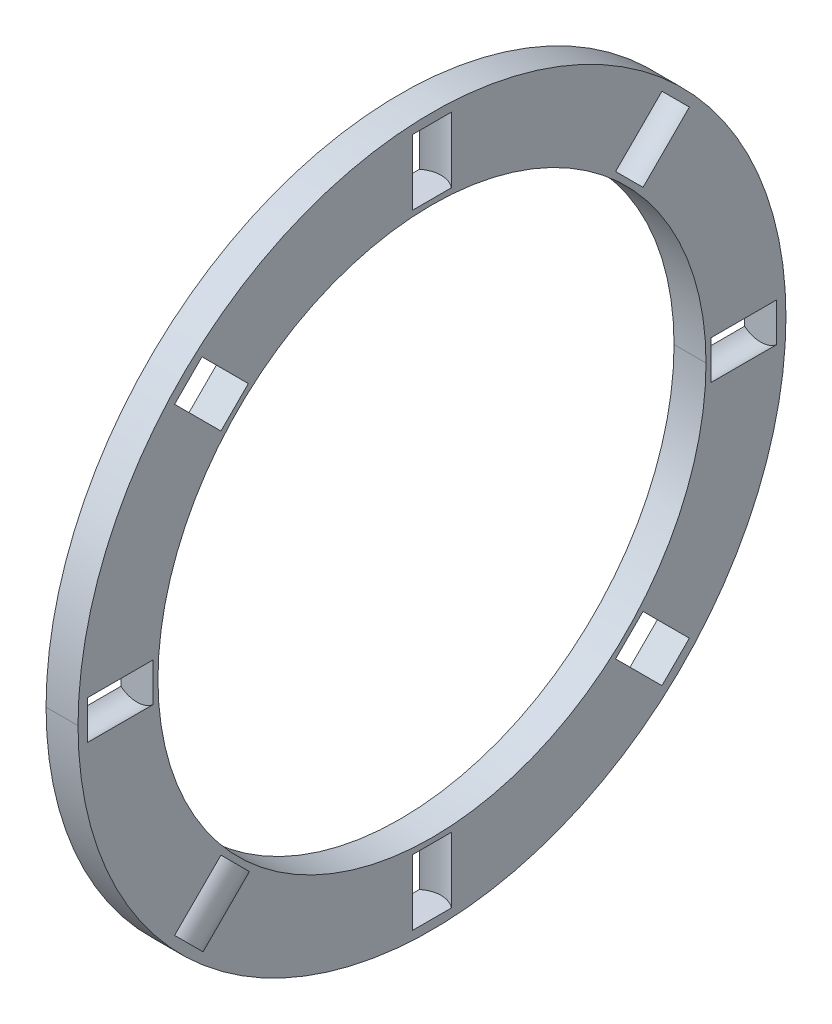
ISO-10303-21;
HEADER;
FILE_DESCRIPTION(('STEP AP214'),'2;1');
FILE_NAME('part.step','',(''),(''),'','','');
FILE_SCHEMA(('AUTOMOTIVE_DESIGN { 1 0 10303 214 1 1 1 1 }'));
ENDSEC;
DATA;
#1=APPLICATION_CONTEXT('core data for automotive mechanical design processes');
#2=APPLICATION_PROTOCOL_DEFINITION('international standard','automotive_design',2000,#1);
#3=PRODUCT_CONTEXT('',#1,'mechanical');
#4=PRODUCT('Part','Part','',(#3));
#5=PRODUCT_RELATED_PRODUCT_CATEGORY('part','',(#4));
#6=PRODUCT_DEFINITION_FORMATION('','',#4);
#7=PRODUCT_DEFINITION_CONTEXT('part definition',#1,'design');
#8=PRODUCT_DEFINITION('design','',#6,#7);
#9=PRODUCT_DEFINITION_SHAPE('','',#8);
#10=(LENGTH_UNIT() NAMED_UNIT(*) SI_UNIT(.MILLI.,.METRE.));
#11=(NAMED_UNIT(*) PLANE_ANGLE_UNIT() SI_UNIT($,.RADIAN.));
#12=(NAMED_UNIT(*) SI_UNIT($,.STERADIAN.) SOLID_ANGLE_UNIT());
#13=UNCERTAINTY_MEASURE_WITH_UNIT(LENGTH_MEASURE(1.E-05),#10,'distance_accuracy_value','');
#14=(GEOMETRIC_REPRESENTATION_CONTEXT(3) GLOBAL_UNCERTAINTY_ASSIGNED_CONTEXT((#13)) GLOBAL_UNIT_ASSIGNED_CONTEXT((#10,
#11,#12)) REPRESENTATION_CONTEXT('',''));
#15=CARTESIAN_POINT('',(0.,0.,0.));
#16=DIRECTION('',(0.,0.,1.));
#17=DIRECTION('',(1.,0.,0.));
#18=AXIS2_PLACEMENT_3D('',#15,#16,#17);
#19=CARTESIAN_POINT('',(12.5,43.2059920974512,-43.2059920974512));
#20=DIRECTION('',(0.,0.707106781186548,-0.707106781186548));
#21=DIRECTION('',(0.,0.707106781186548,0.707106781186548));
#22=AXIS2_PLACEMENT_3D('',#19,#20,#21);
#23=PLANE('',#22);
#24=DIRECTION('',(0.,0.707106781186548,0.707106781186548));
#25=VECTOR('',#24,1.);
#26=CARTESIAN_POINT('',(16.,73.2059920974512,-13.2059920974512));
#27=LINE('',#26,#25);
#28=CARTESIAN_POINT('',(16.,40.2059920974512,-46.2059920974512));
#29=VERTEX_POINT('',#28);
#30=CARTESIAN_POINT('',(16.,46.2059920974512,-40.2059920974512));
#31=VERTEX_POINT('',#30);
#32=EDGE_CURVE('E11',#29,#31,#27,.T.);
#33=ORIENTED_EDGE('',*,*,#32,.F.);
#34=CARTESIAN_POINT('',(12.5,43.2059920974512,-43.2059920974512));
#35=DIRECTION('',(0.,0.707106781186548,-0.707106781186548));
#36=DIRECTION('',(0.,0.707106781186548,0.707106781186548));
#37=AXIS2_PLACEMENT_3D('',#34,#35,#36);
#38=CIRCLE('',#37,5.5);
#39=CARTESIAN_POINT('',(9.,40.2059920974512,-46.2059920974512));
#40=VERTEX_POINT('',#39);
#41=EDGE_CURVE('E25',#29,#40,#38,.T.);
#42=ORIENTED_EDGE('',*,*,#41,.T.);
#43=DIRECTION('',(0.,-0.707106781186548,-0.707106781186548));
#44=VECTOR('',#43,1.);
#45=CARTESIAN_POINT('',(9.,81.9559920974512,-4.45599209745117));
#46=LINE('',#45,#44);
#47=CARTESIAN_POINT('',(9.,46.2059920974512,-40.2059920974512));
#48=VERTEX_POINT('',#47);
#49=EDGE_CURVE('E565',#48,#40,#46,.T.);
#50=ORIENTED_EDGE('',*,*,#49,.F.);
#51=CARTESIAN_POINT('',(12.5,43.2059920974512,-43.2059920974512));
#52=DIRECTION('',(0.,0.707106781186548,-0.707106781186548));
#53=DIRECTION('',(0.,0.707106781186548,0.707106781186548));
#54=AXIS2_PLACEMENT_3D('',#51,#52,#53);
#55=CIRCLE('',#54,5.5);
#56=EDGE_CURVE('E561',#48,#31,#55,.T.);
#57=ORIENTED_EDGE('',*,*,#56,.T.);
#58=EDGE_LOOP('',(#33,#42,#50,#57));
#59=FACE_BOUND('',#58,.T.);
#60=ADVANCED_FACE('F17',(#59),#23,.T.);
#61=CARTESIAN_POINT('',(12.5,53.3529744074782,-53.3529744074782));
#62=DIRECTION('',(0.,-0.707106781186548,0.707106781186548));
#63=DIRECTION('',(0.,-0.707106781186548,-0.707106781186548));
#64=AXIS2_PLACEMENT_3D('',#61,#62,#63);
#65=CYLINDRICAL_SURFACE('',#64,5.5);
#66=DIRECTION('',(0.,0.707106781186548,-0.707106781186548));
#67=VECTOR('',#66,1.);
#68=CARTESIAN_POINT('',(9.,56.3529744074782,-50.3529744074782));
#69=LINE('',#68,#67);
#70=CARTESIAN_POINT('',(9.,56.3529744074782,-50.3529744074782));
#71=VERTEX_POINT('',#70);
#72=EDGE_CURVE('E557',#48,#71,#69,.T.);
#73=ORIENTED_EDGE('',*,*,#72,.T.);
#74=CARTESIAN_POINT('',(12.5,53.3529744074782,-53.3529744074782));
#75=DIRECTION('',(0.,0.707106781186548,-0.707106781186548));
#76=DIRECTION('',(0.,0.707106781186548,0.707106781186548));
#77=AXIS2_PLACEMENT_3D('',#74,#75,#76);
#78=CIRCLE('',#77,5.5);
#79=CARTESIAN_POINT('',(16.,56.3529744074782,-50.3529744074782));
#80=VERTEX_POINT('',#79);
#81=EDGE_CURVE('E553',#71,#80,#78,.T.);
#82=ORIENTED_EDGE('',*,*,#81,.T.);
#83=DIRECTION('',(0.,0.707106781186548,-0.707106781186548));
#84=VECTOR('',#83,1.);
#85=CARTESIAN_POINT('',(16.,56.3529744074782,-50.3529744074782));
#86=LINE('',#85,#84);
#87=EDGE_CURVE('E548',#31,#80,#86,.T.);
#88=ORIENTED_EDGE('',*,*,#87,.F.);
#89=ORIENTED_EDGE('',*,*,#56,.F.);
#90=EDGE_LOOP('',(#73,#82,#88,#89));
#91=FACE_BOUND('',#90,.T.);
#92=ADVANCED_FACE('F861',(#91),#65,.F.);
#93=CARTESIAN_POINT('',(16.,60.,0.));
#94=DIRECTION('',(1.,0.,0.));
#95=DIRECTION('',(0.,0.,-1.));
#96=AXIS2_PLACEMENT_3D('',#93,#94,#95);
#97=PLANE('',#96);
#98=CARTESIAN_POINT('',(16.,0.,0.));
#99=DIRECTION('',(1.,0.,0.));
#100=DIRECTION('',(0.,0.,-1.));
#101=AXIS2_PLACEMENT_3D('',#98,#99,#100);
#102=CIRCLE('',#101,77.5);
#103=CARTESIAN_POINT('',(16.,0.,-77.5));
#104=VERTEX_POINT('',#103);
#105=CARTESIAN_POINT('',(16.,0.,77.5));
#106=VERTEX_POINT('',#105);
#107=EDGE_CURVE('E544',#104,#106,#102,.T.);
#108=ORIENTED_EDGE('',*,*,#107,.T.);
#109=CARTESIAN_POINT('',(16.,0.,0.));
#110=DIRECTION('',(1.,0.,0.));
#111=DIRECTION('',(0.,0.,-1.));
#112=AXIS2_PLACEMENT_3D('',#109,#110,#111);
#113=CIRCLE('',#112,77.5);
#114=EDGE_CURVE('E540',#106,#104,#113,.T.);
#115=ORIENTED_EDGE('',*,*,#114,.T.);
#116=EDGE_LOOP('',(#108,#115));
#117=FACE_BOUND('',#116,.T.);
#118=DIRECTION('',(0.,-1.,0.));
#119=VECTOR('',#118,1.);
#120=CARTESIAN_POINT('',(16.,61.1025,-4.24264068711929));
#121=LINE('',#120,#119);
#122=CARTESIAN_POINT('',(16.,75.4525,-4.24264068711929));
#123=VERTEX_POINT('',#122);
#124=CARTESIAN_POINT('',(16.,61.1025,-4.24264068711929));
#125=VERTEX_POINT('',#124);
#126=EDGE_CURVE('E536',#123,#125,#121,.T.);
#127=ORIENTED_EDGE('',*,*,#126,.T.);
#128=DIRECTION('',(0.,0.,1.));
#129=VECTOR('',#128,1.);
#130=CARTESIAN_POINT('',(16.,61.1025,0.));
#131=LINE('',#130,#129);
#132=CARTESIAN_POINT('',(16.,61.1025,4.24264068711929));
#133=VERTEX_POINT('',#132);
#134=EDGE_CURVE('E532',#125,#133,#131,.T.);
#135=ORIENTED_EDGE('',*,*,#134,.T.);
#136=DIRECTION('',(0.,-1.,0.));
#137=VECTOR('',#136,1.);
#138=CARTESIAN_POINT('',(16.,61.1025,4.24264068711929));
#139=LINE('',#138,#137);
#140=CARTESIAN_POINT('',(16.,75.4525,4.24264068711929));
#141=VERTEX_POINT('',#140);
#142=EDGE_CURVE('E527',#141,#133,#139,.T.);
#143=ORIENTED_EDGE('',*,*,#142,.F.);
#144=DIRECTION('',(0.,0.,-1.));
#145=VECTOR('',#144,1.);
#146=CARTESIAN_POINT('',(16.,75.4525,0.));
#147=LINE('',#146,#145);
#148=EDGE_CURVE('E523',#141,#123,#147,.T.);
#149=ORIENTED_EDGE('',*,*,#148,.T.);
#150=EDGE_LOOP('',(#127,#135,#143,#149));
#151=FACE_BOUND('',#150,.T.);
#152=CARTESIAN_POINT('',(16.,0.,0.));
#153=DIRECTION('',(1.,0.,0.));
#154=DIRECTION('',(0.,0.,-1.));
#155=AXIS2_PLACEMENT_3D('',#152,#153,#154);
#156=CIRCLE('',#155,60.);
#157=CARTESIAN_POINT('',(16.,0.,-60.));
#158=VERTEX_POINT('',#157);
#159=CARTESIAN_POINT('',(16.,0.,60.));
#160=VERTEX_POINT('',#159);
#161=EDGE_CURVE('E518',#158,#160,#156,.T.);
#162=ORIENTED_EDGE('',*,*,#161,.F.);
#163=CARTESIAN_POINT('',(16.,0.,0.));
#164=DIRECTION('',(1.,0.,0.));
#165=DIRECTION('',(0.,0.,-1.));
#166=AXIS2_PLACEMENT_3D('',#163,#164,#165);
#167=CIRCLE('',#166,60.);
#168=EDGE_CURVE('E513',#160,#158,#167,.T.);
#169=ORIENTED_EDGE('',*,*,#168,.F.);
#170=EDGE_LOOP('',(#162,#169));
#171=FACE_BOUND('',#170,.T.);
#172=DIRECTION('',(0.,-1.,0.));
#173=VECTOR('',#172,1.);
#174=CARTESIAN_POINT('',(16.,-75.4525,4.24264068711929));
#175=LINE('',#174,#173);
#176=CARTESIAN_POINT('',(16.,-61.1025,4.24264068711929));
#177=VERTEX_POINT('',#176);
#178=CARTESIAN_POINT('',(16.,-75.4525,4.24264068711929));
#179=VERTEX_POINT('',#178);
#180=EDGE_CURVE('E508',#177,#179,#175,.T.);
#181=ORIENTED_EDGE('',*,*,#180,.F.);
#182=DIRECTION('',(0.,0.,-1.));
#183=VECTOR('',#182,1.);
#184=CARTESIAN_POINT('',(16.,-61.1025,0.));
#185=LINE('',#184,#183);
#186=CARTESIAN_POINT('',(16.,-61.1025,-4.24264068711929));
#187=VERTEX_POINT('',#186);
#188=EDGE_CURVE('E504',#177,#187,#185,.T.);
#189=ORIENTED_EDGE('',*,*,#188,.T.);
#190=DIRECTION('',(0.,-1.,0.));
#191=VECTOR('',#190,1.);
#192=CARTESIAN_POINT('',(16.,-75.4525,-4.24264068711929));
#193=LINE('',#192,#191);
#194=CARTESIAN_POINT('',(16.,-75.4525,-4.24264068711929));
#195=VERTEX_POINT('',#194);
#196=EDGE_CURVE('E500',#187,#195,#193,.T.);
#197=ORIENTED_EDGE('',*,*,#196,.T.);
#198=DIRECTION('',(0.,0.,1.));
#199=VECTOR('',#198,1.);
#200=CARTESIAN_POINT('',(16.,-75.4525,0.));
#201=LINE('',#200,#199);
#202=EDGE_CURVE('E496',#195,#179,#201,.T.);
#203=ORIENTED_EDGE('',*,*,#202,.T.);
#204=EDGE_LOOP('',(#181,#189,#197,#203));
#205=FACE_BOUND('',#204,.T.);
#206=DIRECTION('',(0.,-0.707106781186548,-0.707106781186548));
#207=VECTOR('',#206,1.);
#208=CARTESIAN_POINT('',(16.,40.2059920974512,46.2059920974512));
#209=LINE('',#208,#207);
#210=CARTESIAN_POINT('',(16.,50.3529744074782,56.3529744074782));
#211=VERTEX_POINT('',#210);
#212=CARTESIAN_POINT('',(16.,40.2059920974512,46.2059920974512));
#213=VERTEX_POINT('',#212);
#214=EDGE_CURVE('E491',#211,#213,#209,.T.);
#215=ORIENTED_EDGE('',*,*,#214,.F.);
#216=DIRECTION('',(0.,0.707106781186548,-0.707106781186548));
#217=VECTOR('',#216,1.);
#218=CARTESIAN_POINT('',(16.,83.3529744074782,23.3529744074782));
#219=LINE('',#218,#217);
#220=CARTESIAN_POINT('',(16.,56.3529744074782,50.3529744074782));
#221=VERTEX_POINT('',#220);
#222=EDGE_CURVE('E487',#211,#221,#219,.T.);
#223=ORIENTED_EDGE('',*,*,#222,.T.);
#224=DIRECTION('',(0.,-0.707106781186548,-0.707106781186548));
#225=VECTOR('',#224,1.);
#226=CARTESIAN_POINT('',(16.,46.2059920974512,40.2059920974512));
#227=LINE('',#226,#225);
#228=CARTESIAN_POINT('',(16.,46.2059920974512,40.2059920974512));
#229=VERTEX_POINT('',#228);
#230=EDGE_CURVE('E483',#221,#229,#227,.T.);
#231=ORIENTED_EDGE('',*,*,#230,.T.);
#232=DIRECTION('',(0.,-0.707106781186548,0.707106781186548));
#233=VECTOR('',#232,1.);
#234=CARTESIAN_POINT('',(16.,73.2059920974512,13.2059920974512));
#235=LINE('',#234,#233);
#236=EDGE_CURVE('E479',#229,#213,#235,.T.);
#237=ORIENTED_EDGE('',*,*,#236,.T.);
#238=EDGE_LOOP('',(#215,#223,#231,#237));
#239=FACE_BOUND('',#238,.T.);
#240=DIRECTION('',(0.,-0.707106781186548,-0.707106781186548));
#241=VECTOR('',#240,1.);
#242=CARTESIAN_POINT('',(16.,-56.3529744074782,-50.3529744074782));
#243=LINE('',#242,#241);
#244=CARTESIAN_POINT('',(16.,-46.2059920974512,-40.2059920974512));
#245=VERTEX_POINT('',#244);
#246=CARTESIAN_POINT('',(16.,-56.3529744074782,-50.3529744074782));
#247=VERTEX_POINT('',#246);
#248=EDGE_CURVE('E474',#245,#247,#243,.T.);
#249=ORIENTED_EDGE('',*,*,#248,.F.);
#250=DIRECTION('',(0.,0.707106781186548,-0.707106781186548));
#251=VECTOR('',#250,1.);
#252=CARTESIAN_POINT('',(16.,-13.2059920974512,-73.2059920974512));
#253=LINE('',#252,#251);
#254=CARTESIAN_POINT('',(16.,-40.2059920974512,-46.2059920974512));
#255=VERTEX_POINT('',#254);
#256=EDGE_CURVE('E470',#245,#255,#253,.T.);
#257=ORIENTED_EDGE('',*,*,#256,.T.);
#258=DIRECTION('',(0.,-0.707106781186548,-0.707106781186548));
#259=VECTOR('',#258,1.);
#260=CARTESIAN_POINT('',(16.,-50.3529744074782,-56.3529744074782));
#261=LINE('',#260,#259);
#262=CARTESIAN_POINT('',(16.,-50.3529744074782,-56.3529744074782));
#263=VERTEX_POINT('',#262);
#264=EDGE_CURVE('E466',#255,#263,#261,.T.);
#265=ORIENTED_EDGE('',*,*,#264,.T.);
#266=DIRECTION('',(0.,-0.707106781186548,0.707106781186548));
#267=VECTOR('',#266,1.);
#268=CARTESIAN_POINT('',(16.,-23.3529744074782,-83.3529744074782));
#269=LINE('',#268,#267);
#270=EDGE_CURVE('E462',#263,#247,#269,.T.);
#271=ORIENTED_EDGE('',*,*,#270,.T.);
#272=EDGE_LOOP('',(#249,#257,#265,#271));
#273=FACE_BOUND('',#272,.T.);
#274=DIRECTION('',(0.,0.,-1.));
#275=VECTOR('',#274,1.);
#276=CARTESIAN_POINT('',(16.,-4.24264068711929,61.1025));
#277=LINE('',#276,#275);
#278=CARTESIAN_POINT('',(16.,-4.24264068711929,75.4525));
#279=VERTEX_POINT('',#278);
#280=CARTESIAN_POINT('',(16.,-4.24264068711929,61.1025));
#281=VERTEX_POINT('',#280);
#282=EDGE_CURVE('E457',#279,#281,#277,.T.);
#283=ORIENTED_EDGE('',*,*,#282,.F.);
#284=DIRECTION('',(0.,1.,0.));
#285=VECTOR('',#284,1.);
#286=CARTESIAN_POINT('',(16.,60.,75.4525));
#287=LINE('',#286,#285);
#288=CARTESIAN_POINT('',(16.,4.24264068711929,75.4525));
#289=VERTEX_POINT('',#288);
#290=EDGE_CURVE('E453',#279,#289,#287,.T.);
#291=ORIENTED_EDGE('',*,*,#290,.T.);
#292=DIRECTION('',(0.,0.,-1.));
#293=VECTOR('',#292,1.);
#294=CARTESIAN_POINT('',(16.,4.24264068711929,61.1025));
#295=LINE('',#294,#293);
#296=CARTESIAN_POINT('',(16.,4.24264068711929,61.1025));
#297=VERTEX_POINT('',#296);
#298=EDGE_CURVE('E449',#289,#297,#295,.T.);
#299=ORIENTED_EDGE('',*,*,#298,.T.);
#300=DIRECTION('',(0.,-1.,0.));
#301=VECTOR('',#300,1.);
#302=CARTESIAN_POINT('',(16.,60.,61.1025));
#303=LINE('',#302,#301);
#304=EDGE_CURVE('E445',#297,#281,#303,.T.);
#305=ORIENTED_EDGE('',*,*,#304,.T.);
#306=EDGE_LOOP('',(#283,#291,#299,#305));
#307=FACE_BOUND('',#306,.T.);
#308=DIRECTION('',(0.,0.,-1.));
#309=VECTOR('',#308,1.);
#310=CARTESIAN_POINT('',(16.,-4.24264068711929,-75.4525));
#311=LINE('',#310,#309);
#312=CARTESIAN_POINT('',(16.,-4.24264068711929,-61.1025));
#313=VERTEX_POINT('',#312);
#314=CARTESIAN_POINT('',(16.,-4.24264068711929,-75.4525));
#315=VERTEX_POINT('',#314);
#316=EDGE_CURVE('E440',#313,#315,#311,.T.);
#317=ORIENTED_EDGE('',*,*,#316,.F.);
#318=DIRECTION('',(0.,1.,0.));
#319=VECTOR('',#318,1.);
#320=CARTESIAN_POINT('',(16.,60.,-61.1025));
#321=LINE('',#320,#319);
#322=CARTESIAN_POINT('',(16.,4.24264068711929,-61.1025));
#323=VERTEX_POINT('',#322);
#324=EDGE_CURVE('E436',#313,#323,#321,.T.);
#325=ORIENTED_EDGE('',*,*,#324,.T.);
#326=DIRECTION('',(0.,0.,-1.));
#327=VECTOR('',#326,1.);
#328=CARTESIAN_POINT('',(16.,4.24264068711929,-75.4525));
#329=LINE('',#328,#327);
#330=CARTESIAN_POINT('',(16.,4.24264068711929,-75.4525));
#331=VERTEX_POINT('',#330);
#332=EDGE_CURVE('E432',#323,#331,#329,.T.);
#333=ORIENTED_EDGE('',*,*,#332,.T.);
#334=DIRECTION('',(0.,-1.,0.));
#335=VECTOR('',#334,1.);
#336=CARTESIAN_POINT('',(16.,60.,-75.4525));
#337=LINE('',#336,#335);
#338=EDGE_CURVE('E428',#331,#315,#337,.T.);
#339=ORIENTED_EDGE('',*,*,#338,.T.);
#340=EDGE_LOOP('',(#317,#325,#333,#339));
#341=FACE_BOUND('',#340,.T.);
#342=DIRECTION('',(0.,0.707106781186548,-0.707106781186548));
#343=VECTOR('',#342,1.);
#344=CARTESIAN_POINT('',(16.,-46.2059920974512,40.2059920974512));
#345=LINE('',#344,#343);
#346=CARTESIAN_POINT('',(16.,-56.3529744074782,50.3529744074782));
#347=VERTEX_POINT('',#346);
#348=CARTESIAN_POINT('',(16.,-46.2059920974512,40.2059920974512));
#349=VERTEX_POINT('',#348);
#350=EDGE_CURVE('E423',#347,#349,#345,.T.);
#351=ORIENTED_EDGE('',*,*,#350,.F.);
#352=DIRECTION('',(0.,0.707106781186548,0.707106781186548));
#353=VECTOR('',#352,1.);
#354=CARTESIAN_POINT('',(16.,-23.3529744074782,83.3529744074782));
#355=LINE('',#354,#353);
#356=CARTESIAN_POINT('',(16.,-50.3529744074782,56.3529744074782));
#357=VERTEX_POINT('',#356);
#358=EDGE_CURVE('E419',#347,#357,#355,.T.);
#359=ORIENTED_EDGE('',*,*,#358,.T.);
#360=DIRECTION('',(0.,0.707106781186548,-0.707106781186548));
#361=VECTOR('',#360,1.);
#362=CARTESIAN_POINT('',(16.,-40.2059920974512,46.2059920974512));
#363=LINE('',#362,#361);
#364=CARTESIAN_POINT('',(16.,-40.2059920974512,46.2059920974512));
#365=VERTEX_POINT('',#364);
#366=EDGE_CURVE('E415',#357,#365,#363,.T.);
#367=ORIENTED_EDGE('',*,*,#366,.T.);
#368=DIRECTION('',(0.,-0.707106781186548,-0.707106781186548));
#369=VECTOR('',#368,1.);
#370=CARTESIAN_POINT('',(16.,-13.2059920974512,73.2059920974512));
#371=LINE('',#370,#369);
#372=EDGE_CURVE('E411',#365,#349,#371,.T.);
#373=ORIENTED_EDGE('',*,*,#372,.T.);
#374=EDGE_LOOP('',(#351,#359,#367,#373));
#375=FACE_BOUND('',#374,.T.);
#376=DIRECTION('',(0.,0.707106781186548,-0.707106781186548));
#377=VECTOR('',#376,1.);
#378=CARTESIAN_POINT('',(16.,50.3529744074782,-56.3529744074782));
#379=LINE('',#378,#377);
#380=CARTESIAN_POINT('',(16.,50.3529744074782,-56.3529744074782));
#381=VERTEX_POINT('',#380);
#382=EDGE_CURVE('E406',#29,#381,#379,.T.);
#383=ORIENTED_EDGE('',*,*,#382,.F.);
#384=ORIENTED_EDGE('',*,*,#32,.T.);
#385=ORIENTED_EDGE('',*,*,#87,.T.);
#386=DIRECTION('',(0.,-0.707106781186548,-0.707106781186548));
#387=VECTOR('',#386,1.);
#388=CARTESIAN_POINT('',(16.,83.3529744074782,-23.3529744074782));
#389=LINE('',#388,#387);
#390=EDGE_CURVE('E402',#80,#381,#389,.T.);
#391=ORIENTED_EDGE('',*,*,#390,.T.);
#392=EDGE_LOOP('',(#383,#384,#385,#391));
#393=FACE_BOUND('',#392,.T.);
#394=ADVANCED_FACE('F848',(#117,#151,#171,#205,#239,#273,#307,#341,#375,#393),#97,.T.);
#395=CARTESIAN_POINT('',(18.,53.3529744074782,-53.3529744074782));
#396=DIRECTION('',(0.,-0.707106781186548,0.707106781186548));
#397=DIRECTION('',(0.,-0.707106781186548,-0.707106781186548));
#398=AXIS2_PLACEMENT_3D('',#395,#396,#397);
#399=PLANE('',#398);
#400=CARTESIAN_POINT('',(12.5,53.3529744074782,-53.3529744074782));
#401=DIRECTION('',(0.,0.707106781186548,-0.707106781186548));
#402=DIRECTION('',(0.,0.707106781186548,0.707106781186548));
#403=AXIS2_PLACEMENT_3D('',#400,#401,#402);
#404=CIRCLE('',#403,5.5);
#405=CARTESIAN_POINT('',(9.,50.3529744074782,-56.3529744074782));
#406=VERTEX_POINT('',#405);
#407=EDGE_CURVE('E397',#381,#406,#404,.T.);
#408=ORIENTED_EDGE('',*,*,#407,.F.);
#409=ORIENTED_EDGE('',*,*,#390,.F.);
#410=ORIENTED_EDGE('',*,*,#81,.F.);
#411=DIRECTION('',(0.,0.707106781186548,0.707106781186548));
#412=VECTOR('',#411,1.);
#413=CARTESIAN_POINT('',(9.,92.1029744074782,-14.6029744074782));
#414=LINE('',#413,#412);
#415=EDGE_CURVE('E392',#406,#71,#414,.T.);
#416=ORIENTED_EDGE('',*,*,#415,.F.);
#417=EDGE_LOOP('',(#408,#409,#410,#416));
#418=FACE_BOUND('',#417,.T.);
#419=ADVANCED_FACE('F869',(#418),#399,.T.);
#420=CARTESIAN_POINT('',(9.,77.5,0.));
#421=DIRECTION('',(-1.,0.,0.));
#422=DIRECTION('',(0.,0.,1.));
#423=AXIS2_PLACEMENT_3D('',#420,#421,#422);
#424=PLANE('',#423);
#425=CARTESIAN_POINT('',(9.,0.,0.));
#426=DIRECTION('',(1.,0.,0.));
#427=DIRECTION('',(0.,0.,-1.));
#428=AXIS2_PLACEMENT_3D('',#425,#426,#427);
#429=CIRCLE('',#428,60.);
#430=CARTESIAN_POINT('',(9.,0.,-60.));
#431=VERTEX_POINT('',#430);
#432=CARTESIAN_POINT('',(9.,0.,60.));
#433=VERTEX_POINT('',#432);
#434=EDGE_CURVE('E388',#431,#433,#429,.T.);
#435=ORIENTED_EDGE('',*,*,#434,.T.);
#436=CARTESIAN_POINT('',(9.,0.,0.));
#437=DIRECTION('',(1.,0.,0.));
#438=DIRECTION('',(0.,0.,-1.));
#439=AXIS2_PLACEMENT_3D('',#436,#437,#438);
#440=CIRCLE('',#439,60.);
#441=EDGE_CURVE('E384',#433,#431,#440,.T.);
#442=ORIENTED_EDGE('',*,*,#441,.T.);
#443=EDGE_LOOP('',(#435,#442));
#444=FACE_BOUND('',#443,.T.);
#445=DIRECTION('',(0.,0.,1.));
#446=VECTOR('',#445,1.);
#447=CARTESIAN_POINT('',(9.,75.4525,0.));
#448=LINE('',#447,#446);
#449=CARTESIAN_POINT('',(9.,75.4525,-4.24264068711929));
#450=VERTEX_POINT('',#449);
#451=CARTESIAN_POINT('',(9.,75.4525,4.24264068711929));
#452=VERTEX_POINT('',#451);
#453=EDGE_CURVE('E380',#450,#452,#448,.T.);
#454=ORIENTED_EDGE('',*,*,#453,.T.);
#455=DIRECTION('',(0.,-1.,0.));
#456=VECTOR('',#455,1.);
#457=CARTESIAN_POINT('',(9.,61.1025,4.24264068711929));
#458=LINE('',#457,#456);
#459=CARTESIAN_POINT('',(9.,61.1025,4.24264068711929));
#460=VERTEX_POINT('',#459);
#461=EDGE_CURVE('E376',#452,#460,#458,.T.);
#462=ORIENTED_EDGE('',*,*,#461,.T.);
#463=DIRECTION('',(0.,0.,-1.));
#464=VECTOR('',#463,1.);
#465=CARTESIAN_POINT('',(9.,61.1025,0.));
#466=LINE('',#465,#464);
#467=CARTESIAN_POINT('',(9.,61.1025,-4.24264068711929));
#468=VERTEX_POINT('',#467);
#469=EDGE_CURVE('E372',#460,#468,#466,.T.);
#470=ORIENTED_EDGE('',*,*,#469,.T.);
#471=DIRECTION('',(0.,-1.,0.));
#472=VECTOR('',#471,1.);
#473=CARTESIAN_POINT('',(9.,61.1025,-4.24264068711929));
#474=LINE('',#473,#472);
#475=EDGE_CURVE('E367',#450,#468,#474,.T.);
#476=ORIENTED_EDGE('',*,*,#475,.F.);
#477=EDGE_LOOP('',(#454,#462,#470,#476));
#478=FACE_BOUND('',#477,.T.);
#479=CARTESIAN_POINT('',(9.,0.,0.));
#480=DIRECTION('',(1.,0.,0.));
#481=DIRECTION('',(0.,0.,-1.));
#482=AXIS2_PLACEMENT_3D('',#479,#480,#481);
#483=CIRCLE('',#482,77.5);
#484=CARTESIAN_POINT('',(9.,0.,-77.5));
#485=VERTEX_POINT('',#484);
#486=CARTESIAN_POINT('',(9.,0.,77.5));
#487=VERTEX_POINT('',#486);
#488=EDGE_CURVE('E362',#485,#487,#483,.T.);
#489=ORIENTED_EDGE('',*,*,#488,.F.);
#490=CARTESIAN_POINT('',(9.,0.,0.));
#491=DIRECTION('',(1.,0.,0.));
#492=DIRECTION('',(0.,0.,-1.));
#493=AXIS2_PLACEMENT_3D('',#490,#491,#492);
#494=CIRCLE('',#493,77.5);
#495=EDGE_CURVE('E357',#487,#485,#494,.T.);
#496=ORIENTED_EDGE('',*,*,#495,.F.);
#497=EDGE_LOOP('',(#489,#496));
#498=FACE_BOUND('',#497,.T.);
#499=DIRECTION('',(0.,-1.,0.));
#500=VECTOR('',#499,1.);
#501=CARTESIAN_POINT('',(9.,-75.4525,-4.24264068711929));
#502=LINE('',#501,#500);
#503=CARTESIAN_POINT('',(9.,-61.1025,-4.24264068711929));
#504=VERTEX_POINT('',#503);
#505=CARTESIAN_POINT('',(9.,-75.4525,-4.24264068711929));
#506=VERTEX_POINT('',#505);
#507=EDGE_CURVE('E352',#504,#506,#502,.T.);
#508=ORIENTED_EDGE('',*,*,#507,.F.);
#509=DIRECTION('',(0.,0.,1.));
#510=VECTOR('',#509,1.);
#511=CARTESIAN_POINT('',(9.,-61.1025,0.));
#512=LINE('',#511,#510);
#513=CARTESIAN_POINT('',(9.,-61.1025,4.24264068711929));
#514=VERTEX_POINT('',#513);
#515=EDGE_CURVE('E348',#504,#514,#512,.T.);
#516=ORIENTED_EDGE('',*,*,#515,.T.);
#517=DIRECTION('',(0.,-1.,0.));
#518=VECTOR('',#517,1.);
#519=CARTESIAN_POINT('',(9.,-75.4525,4.24264068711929));
#520=LINE('',#519,#518);
#521=CARTESIAN_POINT('',(9.,-75.4525,4.24264068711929));
#522=VERTEX_POINT('',#521);
#523=EDGE_CURVE('E344',#514,#522,#520,.T.);
#524=ORIENTED_EDGE('',*,*,#523,.T.);
#525=DIRECTION('',(0.,0.,-1.));
#526=VECTOR('',#525,1.);
#527=CARTESIAN_POINT('',(9.,-75.4525,0.));
#528=LINE('',#527,#526);
#529=EDGE_CURVE('E340',#522,#506,#528,.T.);
#530=ORIENTED_EDGE('',*,*,#529,.T.);
#531=EDGE_LOOP('',(#508,#516,#524,#530));
#532=FACE_BOUND('',#531,.T.);
#533=DIRECTION('',(0.,-0.707106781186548,-0.707106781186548));
#534=VECTOR('',#533,1.);
#535=CARTESIAN_POINT('',(9.,46.2059920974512,40.2059920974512));
#536=LINE('',#535,#534);
#537=CARTESIAN_POINT('',(9.,56.3529744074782,50.3529744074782));
#538=VERTEX_POINT('',#537);
#539=CARTESIAN_POINT('',(9.,46.2059920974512,40.2059920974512));
#540=VERTEX_POINT('',#539);
#541=EDGE_CURVE('E335',#538,#540,#536,.T.);
#542=ORIENTED_EDGE('',*,*,#541,.F.);
#543=DIRECTION('',(0.,-0.707106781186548,0.707106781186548));
#544=VECTOR('',#543,1.);
#545=CARTESIAN_POINT('',(9.,92.1029744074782,14.6029744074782));
#546=LINE('',#545,#544);
#547=CARTESIAN_POINT('',(9.,50.3529744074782,56.3529744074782));
#548=VERTEX_POINT('',#547);
#549=EDGE_CURVE('E331',#538,#548,#546,.T.);
#550=ORIENTED_EDGE('',*,*,#549,.T.);
#551=DIRECTION('',(0.,-0.707106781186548,-0.707106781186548));
#552=VECTOR('',#551,1.);
#553=CARTESIAN_POINT('',(9.,40.2059920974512,46.2059920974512));
#554=LINE('',#553,#552);
#555=CARTESIAN_POINT('',(9.,40.2059920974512,46.2059920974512));
#556=VERTEX_POINT('',#555);
#557=EDGE_CURVE('E327',#548,#556,#554,.T.);
#558=ORIENTED_EDGE('',*,*,#557,.T.);
#559=DIRECTION('',(0.,0.707106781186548,-0.707106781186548));
#560=VECTOR('',#559,1.);
#561=CARTESIAN_POINT('',(9.,81.9559920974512,4.45599209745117));
#562=LINE('',#561,#560);
#563=EDGE_CURVE('E323',#556,#540,#562,.T.);
#564=ORIENTED_EDGE('',*,*,#563,.T.);
#565=EDGE_LOOP('',(#542,#550,#558,#564));
#566=FACE_BOUND('',#565,.T.);
#567=DIRECTION('',(0.,-0.707106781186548,-0.707106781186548));
#568=VECTOR('',#567,1.);
#569=CARTESIAN_POINT('',(9.,-50.3529744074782,-56.3529744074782));
#570=LINE('',#569,#568);
#571=CARTESIAN_POINT('',(9.,-40.2059920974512,-46.2059920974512));
#572=VERTEX_POINT('',#571);
#573=CARTESIAN_POINT('',(9.,-50.3529744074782,-56.3529744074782));
#574=VERTEX_POINT('',#573);
#575=EDGE_CURVE('E318',#572,#574,#570,.T.);
#576=ORIENTED_EDGE('',*,*,#575,.F.);
#577=DIRECTION('',(0.,-0.707106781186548,0.707106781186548));
#578=VECTOR('',#577,1.);
#579=CARTESIAN_POINT('',(9.,-4.45599209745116,-81.9559920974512));
#580=LINE('',#579,#578);
#581=CARTESIAN_POINT('',(9.,-46.2059920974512,-40.2059920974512));
#582=VERTEX_POINT('',#581);
#583=EDGE_CURVE('E314',#572,#582,#580,.T.);
#584=ORIENTED_EDGE('',*,*,#583,.T.);
#585=DIRECTION('',(0.,-0.707106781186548,-0.707106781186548));
#586=VECTOR('',#585,1.);
#587=CARTESIAN_POINT('',(9.,-56.3529744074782,-50.3529744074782));
#588=LINE('',#587,#586);
#589=CARTESIAN_POINT('',(9.,-56.3529744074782,-50.3529744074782));
#590=VERTEX_POINT('',#589);
#591=EDGE_CURVE('E310',#582,#590,#588,.T.);
#592=ORIENTED_EDGE('',*,*,#591,.T.);
#593=DIRECTION('',(0.,0.707106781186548,-0.707106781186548));
#594=VECTOR('',#593,1.);
#595=CARTESIAN_POINT('',(9.,-14.6029744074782,-92.1029744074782));
#596=LINE('',#595,#594);
#597=EDGE_CURVE('E306',#590,#574,#596,.T.);
#598=ORIENTED_EDGE('',*,*,#597,.T.);
#599=EDGE_LOOP('',(#576,#584,#592,#598));
#600=FACE_BOUND('',#599,.T.);
#601=DIRECTION('',(0.,0.,-1.));
#602=VECTOR('',#601,1.);
#603=CARTESIAN_POINT('',(9.,4.24264068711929,61.1025));
#604=LINE('',#603,#602);
#605=CARTESIAN_POINT('',(9.,4.24264068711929,75.4525));
#606=VERTEX_POINT('',#605);
#607=CARTESIAN_POINT('',(9.,4.24264068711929,61.1025));
#608=VERTEX_POINT('',#607);
#609=EDGE_CURVE('E301',#606,#608,#604,.T.);
#610=ORIENTED_EDGE('',*,*,#609,.F.);
#611=DIRECTION('',(0.,-1.,0.));
#612=VECTOR('',#611,1.);
#613=CARTESIAN_POINT('',(9.,77.5,75.4525));
#614=LINE('',#613,#612);
#615=CARTESIAN_POINT('',(9.,-4.24264068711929,75.4525));
#616=VERTEX_POINT('',#615);
#617=EDGE_CURVE('E297',#606,#616,#614,.T.);
#618=ORIENTED_EDGE('',*,*,#617,.T.);
#619=DIRECTION('',(0.,0.,-1.));
#620=VECTOR('',#619,1.);
#621=CARTESIAN_POINT('',(9.,-4.24264068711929,61.1025));
#622=LINE('',#621,#620);
#623=CARTESIAN_POINT('',(9.,-4.24264068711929,61.1025));
#624=VERTEX_POINT('',#623);
#625=EDGE_CURVE('E293',#616,#624,#622,.T.);
#626=ORIENTED_EDGE('',*,*,#625,.T.);
#627=DIRECTION('',(0.,1.,0.));
#628=VECTOR('',#627,1.);
#629=CARTESIAN_POINT('',(9.,77.5,61.1025));
#630=LINE('',#629,#628);
#631=EDGE_CURVE('E289',#624,#608,#630,.T.);
#632=ORIENTED_EDGE('',*,*,#631,.T.);
#633=EDGE_LOOP('',(#610,#618,#626,#632));
#634=FACE_BOUND('',#633,.T.);
#635=DIRECTION('',(0.,0.,-1.));
#636=VECTOR('',#635,1.);
#637=CARTESIAN_POINT('',(9.,4.24264068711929,-75.4525));
#638=LINE('',#637,#636);
#639=CARTESIAN_POINT('',(9.,4.24264068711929,-61.1025));
#640=VERTEX_POINT('',#639);
#641=CARTESIAN_POINT('',(9.,4.24264068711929,-75.4525));
#642=VERTEX_POINT('',#641);
#643=EDGE_CURVE('E284',#640,#642,#638,.T.);
#644=ORIENTED_EDGE('',*,*,#643,.F.);
#645=DIRECTION('',(0.,-1.,0.));
#646=VECTOR('',#645,1.);
#647=CARTESIAN_POINT('',(9.,77.5,-61.1025));
#648=LINE('',#647,#646);
#649=CARTESIAN_POINT('',(9.,-4.24264068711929,-61.1025));
#650=VERTEX_POINT('',#649);
#651=EDGE_CURVE('E280',#640,#650,#648,.T.);
#652=ORIENTED_EDGE('',*,*,#651,.T.);
#653=DIRECTION('',(0.,0.,-1.));
#654=VECTOR('',#653,1.);
#655=CARTESIAN_POINT('',(9.,-4.24264068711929,-75.4525));
#656=LINE('',#655,#654);
#657=CARTESIAN_POINT('',(9.,-4.24264068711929,-75.4525));
#658=VERTEX_POINT('',#657);
#659=EDGE_CURVE('E269',#650,#658,#656,.T.);
#660=ORIENTED_EDGE('',*,*,#659,.T.);
#661=DIRECTION('',(0.,1.,0.));
#662=VECTOR('',#661,1.);
#663=CARTESIAN_POINT('',(9.,77.5,-75.4525));
#664=LINE('',#663,#662);
#665=EDGE_CURVE('E266',#658,#642,#664,.T.);
#666=ORIENTED_EDGE('',*,*,#665,.T.);
#667=EDGE_LOOP('',(#644,#652,#660,#666));
#668=FACE_BOUND('',#667,.T.);
#669=DIRECTION('',(0.,0.707106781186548,-0.707106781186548));
#670=VECTOR('',#669,1.);
#671=CARTESIAN_POINT('',(9.,-40.2059920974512,46.2059920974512));
#672=LINE('',#671,#670);
#673=CARTESIAN_POINT('',(9.,-50.3529744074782,56.3529744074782));
#674=VERTEX_POINT('',#673);
#675=CARTESIAN_POINT('',(9.,-40.2059920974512,46.2059920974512));
#676=VERTEX_POINT('',#675);
#677=EDGE_CURVE('E250',#674,#676,#672,.T.);
#678=ORIENTED_EDGE('',*,*,#677,.F.);
#679=DIRECTION('',(0.,-0.707106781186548,-0.707106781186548));
#680=VECTOR('',#679,1.);
#681=CARTESIAN_POINT('',(9.,-14.6029744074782,92.1029744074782));
#682=LINE('',#681,#680);
#683=CARTESIAN_POINT('',(9.,-56.3529744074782,50.3529744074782));
#684=VERTEX_POINT('',#683);
#685=EDGE_CURVE('E267',#674,#684,#682,.T.);
#686=ORIENTED_EDGE('',*,*,#685,.T.);
#687=DIRECTION('',(0.,0.707106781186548,-0.707106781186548));
#688=VECTOR('',#687,1.);
#689=CARTESIAN_POINT('',(9.,-46.2059920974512,40.2059920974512));
#690=LINE('',#689,#688);
#691=CARTESIAN_POINT('',(9.,-46.2059920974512,40.2059920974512));
#692=VERTEX_POINT('',#691);
#693=EDGE_CURVE('E253',#684,#692,#690,.T.);
#694=ORIENTED_EDGE('',*,*,#693,.T.);
#695=DIRECTION('',(0.,0.707106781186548,0.707106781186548));
#696=VECTOR('',#695,1.);
#697=CARTESIAN_POINT('',(9.,-4.45599209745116,81.9559920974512));
#698=LINE('',#697,#696);
#699=EDGE_CURVE('E245',#692,#676,#698,.T.);
#700=ORIENTED_EDGE('',*,*,#699,.T.);
#701=EDGE_LOOP('',(#678,#686,#694,#700));
#702=FACE_BOUND('',#701,.T.);
#703=ORIENTED_EDGE('',*,*,#72,.F.);
#704=ORIENTED_EDGE('',*,*,#49,.T.);
#705=DIRECTION('',(0.,0.707106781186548,-0.707106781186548));
#706=VECTOR('',#705,1.);
#707=CARTESIAN_POINT('',(9.,50.3529744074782,-56.3529744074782));
#708=LINE('',#707,#706);
#709=EDGE_CURVE('E256',#40,#406,#708,.T.);
#710=ORIENTED_EDGE('',*,*,#709,.T.);
#711=ORIENTED_EDGE('',*,*,#415,.T.);
#712=EDGE_LOOP('',(#703,#704,#710,#711));
#713=FACE_BOUND('',#712,.T.);
#714=ADVANCED_FACE('F247',(#444,#478,#498,#532,#566,#600,#634,#668,#702,#713),#424,.T.);
#715=CARTESIAN_POINT('',(12.5,53.3529744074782,-53.3529744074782));
#716=DIRECTION('',(0.,-0.707106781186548,0.707106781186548));
#717=DIRECTION('',(0.,0.707106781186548,0.707106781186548));
#718=AXIS2_PLACEMENT_3D('',#715,#716,#717);
#719=CYLINDRICAL_SURFACE('',#718,5.5);
#720=ORIENTED_EDGE('',*,*,#709,.F.);
#721=ORIENTED_EDGE('',*,*,#41,.F.);
#722=ORIENTED_EDGE('',*,*,#382,.T.);
#723=ORIENTED_EDGE('',*,*,#407,.T.);
#724=EDGE_LOOP('',(#720,#721,#722,#723));
#725=FACE_BOUND('',#724,.T.);
#726=ADVANCED_FACE('F578',(#725),#719,.F.);
#727=CARTESIAN_POINT('',(18.,-43.2059920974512,43.2059920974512));
#728=DIRECTION('',(0.,-0.707106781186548,0.707106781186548));
#729=DIRECTION('',(0.,-0.707106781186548,-0.707106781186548));
#730=AXIS2_PLACEMENT_3D('',#727,#728,#729);
#731=PLANE('',#730);
#732=ORIENTED_EDGE('',*,*,#699,.F.);
#733=CARTESIAN_POINT('',(12.5,-43.2059920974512,43.2059920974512));
#734=DIRECTION('',(0.,0.707106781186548,-0.707106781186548));
#735=DIRECTION('',(0.,0.707106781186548,0.707106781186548));
#736=AXIS2_PLACEMENT_3D('',#733,#734,#735);
#737=CIRCLE('',#736,5.5);
#738=EDGE_CURVE('E258',#692,#676,#737,.T.);
#739=ORIENTED_EDGE('',*,*,#738,.T.);
#740=EDGE_LOOP('',(#732,#739));
#741=FACE_BOUND('',#740,.T.);
#742=ADVANCED_FACE('F259',(#741),#731,.F.);
#743=CARTESIAN_POINT('',(12.5,-43.2059920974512,43.2059920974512));
#744=DIRECTION('',(0.,-0.707106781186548,0.707106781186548));
#745=DIRECTION('',(1.,0.,0.));
#746=AXIS2_PLACEMENT_3D('',#743,#744,#745);
#747=CYLINDRICAL_SURFACE('',#746,5.5);
#748=ORIENTED_EDGE('',*,*,#677,.T.);
#749=ORIENTED_EDGE('',*,*,#738,.F.);
#750=ORIENTED_EDGE('',*,*,#693,.F.);
#751=CARTESIAN_POINT('',(12.5,-53.3529744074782,53.3529744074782));
#752=DIRECTION('',(0.,0.707106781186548,-0.707106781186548));
#753=DIRECTION('',(0.,0.707106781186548,0.707106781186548));
#754=AXIS2_PLACEMENT_3D('',#751,#752,#753);
#755=CIRCLE('',#754,5.5);
#756=EDGE_CURVE('E261',#684,#674,#755,.T.);
#757=ORIENTED_EDGE('',*,*,#756,.T.);
#758=EDGE_LOOP('',(#748,#749,#750,#757));
#759=FACE_BOUND('',#758,.T.);
#760=ADVANCED_FACE('F263',(#759),#747,.T.);
#761=CARTESIAN_POINT('',(12.5,-53.3529744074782,53.3529744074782));
#762=DIRECTION('',(0.,0.707106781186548,-0.707106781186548));
#763=DIRECTION('',(0.,0.707106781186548,0.707106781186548));
#764=AXIS2_PLACEMENT_3D('',#761,#762,#763);
#765=PLANE('',#764);
#766=ORIENTED_EDGE('',*,*,#685,.F.);
#767=ORIENTED_EDGE('',*,*,#756,.F.);
#768=EDGE_LOOP('',(#766,#767));
#769=FACE_BOUND('',#768,.T.);
#770=ADVANCED_FACE('F885',(#769),#765,.F.);
#771=CARTESIAN_POINT('',(18.,0.,-75.4525));
#772=DIRECTION('',(0.,0.,1.));
#773=DIRECTION('',(1.,0.,0.));
#774=AXIS2_PLACEMENT_3D('',#771,#772,#773);
#775=PLANE('',#774);
#776=CARTESIAN_POINT('',(12.5,0.,-75.4525));
#777=DIRECTION('',(0.,0.,-1.));
#778=DIRECTION('',(-1.,0.,0.));
#779=AXIS2_PLACEMENT_3D('',#776,#777,#778);
#780=CIRCLE('',#779,5.5);
#781=EDGE_CURVE('E594',#315,#658,#780,.T.);
#782=ORIENTED_EDGE('',*,*,#781,.F.);
#783=ORIENTED_EDGE('',*,*,#338,.F.);
#784=CARTESIAN_POINT('',(12.5,0.,-75.4525));
#785=DIRECTION('',(0.,0.,-1.));
#786=DIRECTION('',(-1.,0.,0.));
#787=AXIS2_PLACEMENT_3D('',#784,#785,#786);
#788=CIRCLE('',#787,5.5);
#789=EDGE_CURVE('E599',#642,#331,#788,.T.);
#790=ORIENTED_EDGE('',*,*,#789,.F.);
#791=ORIENTED_EDGE('',*,*,#665,.F.);
#792=EDGE_LOOP('',(#782,#783,#790,#791));
#793=FACE_BOUND('',#792,.T.);
#794=ADVANCED_FACE('F888',(#793),#775,.T.);
#795=CARTESIAN_POINT('',(12.5,0.,-75.4525));
#796=DIRECTION('',(0.,0.,1.));
#797=DIRECTION('',(0.,-1.,0.));
#798=AXIS2_PLACEMENT_3D('',#795,#796,#797);
#799=CYLINDRICAL_SURFACE('',#798,5.5);
#800=ORIENTED_EDGE('',*,*,#643,.T.);
#801=ORIENTED_EDGE('',*,*,#789,.T.);
#802=ORIENTED_EDGE('',*,*,#332,.F.);
#803=CARTESIAN_POINT('',(12.5,0.,-61.1025));
#804=DIRECTION('',(0.,0.,-1.));
#805=DIRECTION('',(-1.,0.,0.));
#806=AXIS2_PLACEMENT_3D('',#803,#804,#805);
#807=CIRCLE('',#806,5.5);
#808=EDGE_CURVE('E604',#640,#323,#807,.T.);
#809=ORIENTED_EDGE('',*,*,#808,.F.);
#810=EDGE_LOOP('',(#800,#801,#802,#809));
#811=FACE_BOUND('',#810,.T.);
#812=ADVANCED_FACE('F892',(#811),#799,.F.);
#813=CARTESIAN_POINT('',(12.5,0.,-61.1025));
#814=DIRECTION('',(0.,0.,-1.));
#815=DIRECTION('',(-1.,0.,0.));
#816=AXIS2_PLACEMENT_3D('',#813,#814,#815);
#817=PLANE('',#816);
#818=ORIENTED_EDGE('',*,*,#324,.F.);
#819=CARTESIAN_POINT('',(12.5,0.,-61.1025));
#820=DIRECTION('',(0.,0.,-1.));
#821=DIRECTION('',(-1.,0.,0.));
#822=AXIS2_PLACEMENT_3D('',#819,#820,#821);
#823=CIRCLE('',#822,5.5);
#824=EDGE_CURVE('E609',#313,#650,#823,.T.);
#825=ORIENTED_EDGE('',*,*,#824,.T.);
#826=ORIENTED_EDGE('',*,*,#651,.F.);
#827=ORIENTED_EDGE('',*,*,#808,.T.);
#828=EDGE_LOOP('',(#818,#825,#826,#827));
#829=FACE_BOUND('',#828,.T.);
#830=ADVANCED_FACE('F896',(#829),#817,.T.);
#831=CARTESIAN_POINT('',(12.5,0.,-75.4525));
#832=DIRECTION('',(0.,0.,1.));
#833=DIRECTION('',(0.,1.,0.));
#834=AXIS2_PLACEMENT_3D('',#831,#832,#833);
#835=CYLINDRICAL_SURFACE('',#834,5.5);
#836=ORIENTED_EDGE('',*,*,#659,.F.);
#837=ORIENTED_EDGE('',*,*,#824,.F.);
#838=ORIENTED_EDGE('',*,*,#316,.T.);
#839=ORIENTED_EDGE('',*,*,#781,.T.);
#840=EDGE_LOOP('',(#836,#837,#838,#839));
#841=FACE_BOUND('',#840,.T.);
#842=ADVANCED_FACE('F900',(#841),#835,.F.);
#843=CARTESIAN_POINT('',(18.,0.,61.1025));
#844=DIRECTION('',(0.,0.,1.));
#845=DIRECTION('',(1.,0.,0.));
#846=AXIS2_PLACEMENT_3D('',#843,#844,#845);
#847=PLANE('',#846);
#848=CARTESIAN_POINT('',(12.5,0.,61.1025));
#849=DIRECTION('',(0.,0.,-1.));
#850=DIRECTION('',(-1.,0.,0.));
#851=AXIS2_PLACEMENT_3D('',#848,#849,#850);
#852=CIRCLE('',#851,5.5);
#853=EDGE_CURVE('E614',#281,#624,#852,.T.);
#854=ORIENTED_EDGE('',*,*,#853,.F.);
#855=ORIENTED_EDGE('',*,*,#304,.F.);
#856=CARTESIAN_POINT('',(12.5,0.,61.1025));
#857=DIRECTION('',(0.,0.,-1.));
#858=DIRECTION('',(-1.,0.,0.));
#859=AXIS2_PLACEMENT_3D('',#856,#857,#858);
#860=CIRCLE('',#859,5.5);
#861=EDGE_CURVE('E619',#608,#297,#860,.T.);
#862=ORIENTED_EDGE('',*,*,#861,.F.);
#863=ORIENTED_EDGE('',*,*,#631,.F.);
#864=EDGE_LOOP('',(#854,#855,#862,#863));
#865=FACE_BOUND('',#864,.T.);
#866=ADVANCED_FACE('F904',(#865),#847,.T.);
#867=CARTESIAN_POINT('',(12.5,0.,61.1025));
#868=DIRECTION('',(0.,0.,1.));
#869=DIRECTION('',(0.,-1.,0.));
#870=AXIS2_PLACEMENT_3D('',#867,#868,#869);
#871=CYLINDRICAL_SURFACE('',#870,5.5);
#872=ORIENTED_EDGE('',*,*,#609,.T.);
#873=ORIENTED_EDGE('',*,*,#861,.T.);
#874=ORIENTED_EDGE('',*,*,#298,.F.);
#875=CARTESIAN_POINT('',(12.5,0.,75.4525));
#876=DIRECTION('',(0.,0.,-1.));
#877=DIRECTION('',(-1.,0.,0.));
#878=AXIS2_PLACEMENT_3D('',#875,#876,#877);
#879=CIRCLE('',#878,5.5);
#880=EDGE_CURVE('E624',#606,#289,#879,.T.);
#881=ORIENTED_EDGE('',*,*,#880,.F.);
#882=EDGE_LOOP('',(#872,#873,#874,#881));
#883=FACE_BOUND('',#882,.T.);
#884=ADVANCED_FACE('F908',(#883),#871,.F.);
#885=CARTESIAN_POINT('',(12.5,0.,75.4525));
#886=DIRECTION('',(0.,0.,-1.));
#887=DIRECTION('',(-1.,0.,0.));
#888=AXIS2_PLACEMENT_3D('',#885,#886,#887);
#889=PLANE('',#888);
#890=ORIENTED_EDGE('',*,*,#290,.F.);
#891=CARTESIAN_POINT('',(12.5,0.,75.4525));
#892=DIRECTION('',(0.,0.,-1.));
#893=DIRECTION('',(-1.,0.,0.));
#894=AXIS2_PLACEMENT_3D('',#891,#892,#893);
#895=CIRCLE('',#894,5.5);
#896=EDGE_CURVE('E629',#279,#616,#895,.T.);
#897=ORIENTED_EDGE('',*,*,#896,.T.);
#898=ORIENTED_EDGE('',*,*,#617,.F.);
#899=ORIENTED_EDGE('',*,*,#880,.T.);
#900=EDGE_LOOP('',(#890,#897,#898,#899));
#901=FACE_BOUND('',#900,.T.);
#902=ADVANCED_FACE('F912',(#901),#889,.T.);
#903=CARTESIAN_POINT('',(12.5,0.,61.1025));
#904=DIRECTION('',(0.,0.,1.));
#905=DIRECTION('',(0.,1.,0.));
#906=AXIS2_PLACEMENT_3D('',#903,#904,#905);
#907=CYLINDRICAL_SURFACE('',#906,5.5);
#908=ORIENTED_EDGE('',*,*,#625,.F.);
#909=ORIENTED_EDGE('',*,*,#896,.F.);
#910=ORIENTED_EDGE('',*,*,#282,.T.);
#911=ORIENTED_EDGE('',*,*,#853,.T.);
#912=EDGE_LOOP('',(#908,#909,#910,#911));
#913=FACE_BOUND('',#912,.T.);
#914=ADVANCED_FACE('F916',(#913),#907,.F.);
#915=CARTESIAN_POINT('',(18.,-53.3529744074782,-53.3529744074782));
#916=DIRECTION('',(0.,0.707106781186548,0.707106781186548));
#917=DIRECTION('',(0.,-0.707106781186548,0.707106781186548));
#918=AXIS2_PLACEMENT_3D('',#915,#916,#917);
#919=PLANE('',#918);
#920=CARTESIAN_POINT('',(12.5,-53.3529744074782,-53.3529744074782));
#921=DIRECTION('',(0.,-0.707106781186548,-0.707106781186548));
#922=DIRECTION('',(0.,0.707106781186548,-0.707106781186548));
#923=AXIS2_PLACEMENT_3D('',#920,#921,#922);
#924=CIRCLE('',#923,5.5);
#925=EDGE_CURVE('E634',#247,#590,#924,.T.);
#926=ORIENTED_EDGE('',*,*,#925,.F.);
#927=ORIENTED_EDGE('',*,*,#270,.F.);
#928=CARTESIAN_POINT('',(12.5,-53.3529744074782,-53.3529744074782));
#929=DIRECTION('',(0.,-0.707106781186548,-0.707106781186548));
#930=DIRECTION('',(0.,0.707106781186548,-0.707106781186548));
#931=AXIS2_PLACEMENT_3D('',#928,#929,#930);
#932=CIRCLE('',#931,5.5);
#933=EDGE_CURVE('E639',#574,#263,#932,.T.);
#934=ORIENTED_EDGE('',*,*,#933,.F.);
#935=ORIENTED_EDGE('',*,*,#597,.F.);
#936=EDGE_LOOP('',(#926,#927,#934,#935));
#937=FACE_BOUND('',#936,.T.);
#938=ADVANCED_FACE('F920',(#937),#919,.T.);
#939=CARTESIAN_POINT('',(12.5,-53.3529744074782,-53.3529744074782));
#940=DIRECTION('',(0.,0.707106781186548,0.707106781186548));
#941=DIRECTION('',(0.,-0.707106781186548,0.707106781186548));
#942=AXIS2_PLACEMENT_3D('',#939,#940,#941);
#943=CYLINDRICAL_SURFACE('',#942,5.5);
#944=ORIENTED_EDGE('',*,*,#575,.T.);
#945=ORIENTED_EDGE('',*,*,#933,.T.);
#946=ORIENTED_EDGE('',*,*,#264,.F.);
#947=CARTESIAN_POINT('',(12.5,-43.2059920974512,-43.2059920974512));
#948=DIRECTION('',(0.,-0.707106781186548,-0.707106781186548));
#949=DIRECTION('',(0.,0.707106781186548,-0.707106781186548));
#950=AXIS2_PLACEMENT_3D('',#947,#948,#949);
#951=CIRCLE('',#950,5.5);
#952=EDGE_CURVE('E644',#572,#255,#951,.T.);
#953=ORIENTED_EDGE('',*,*,#952,.F.);
#954=EDGE_LOOP('',(#944,#945,#946,#953));
#955=FACE_BOUND('',#954,.T.);
#956=ADVANCED_FACE('F924',(#955),#943,.F.);
#957=CARTESIAN_POINT('',(12.5,-43.2059920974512,-43.2059920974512));
#958=DIRECTION('',(0.,-0.707106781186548,-0.707106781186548));
#959=DIRECTION('',(0.,0.707106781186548,-0.707106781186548));
#960=AXIS2_PLACEMENT_3D('',#957,#958,#959);
#961=PLANE('',#960);
#962=ORIENTED_EDGE('',*,*,#256,.F.);
#963=CARTESIAN_POINT('',(12.5,-43.2059920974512,-43.2059920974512));
#964=DIRECTION('',(0.,-0.707106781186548,-0.707106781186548));
#965=DIRECTION('',(0.,0.707106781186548,-0.707106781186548));
#966=AXIS2_PLACEMENT_3D('',#963,#964,#965);
#967=CIRCLE('',#966,5.5);
#968=EDGE_CURVE('E649',#245,#582,#967,.T.);
#969=ORIENTED_EDGE('',*,*,#968,.T.);
#970=ORIENTED_EDGE('',*,*,#583,.F.);
#971=ORIENTED_EDGE('',*,*,#952,.T.);
#972=EDGE_LOOP('',(#962,#969,#970,#971));
#973=FACE_BOUND('',#972,.T.);
#974=ADVANCED_FACE('F928',(#973),#961,.T.);
#975=CARTESIAN_POINT('',(12.5,-53.3529744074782,-53.3529744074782));
#976=DIRECTION('',(0.,0.707106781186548,0.707106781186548));
#977=DIRECTION('',(0.,0.707106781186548,-0.707106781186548));
#978=AXIS2_PLACEMENT_3D('',#975,#976,#977);
#979=CYLINDRICAL_SURFACE('',#978,5.5);
#980=ORIENTED_EDGE('',*,*,#591,.F.);
#981=ORIENTED_EDGE('',*,*,#968,.F.);
#982=ORIENTED_EDGE('',*,*,#248,.T.);
#983=ORIENTED_EDGE('',*,*,#925,.T.);
#984=EDGE_LOOP('',(#980,#981,#982,#983));
#985=FACE_BOUND('',#984,.T.);
#986=ADVANCED_FACE('F932',(#985),#979,.F.);
#987=CARTESIAN_POINT('',(18.,43.2059920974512,43.2059920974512));
#988=DIRECTION('',(0.,0.707106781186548,0.707106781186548));
#989=DIRECTION('',(0.,-0.707106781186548,0.707106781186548));
#990=AXIS2_PLACEMENT_3D('',#987,#988,#989);
#991=PLANE('',#990);
#992=CARTESIAN_POINT('',(12.5,43.2059920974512,43.2059920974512));
#993=DIRECTION('',(0.,-0.707106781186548,-0.707106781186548));
#994=DIRECTION('',(0.,0.707106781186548,-0.707106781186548));
#995=AXIS2_PLACEMENT_3D('',#992,#993,#994);
#996=CIRCLE('',#995,5.5);
#997=EDGE_CURVE('E654',#213,#556,#996,.T.);
#998=ORIENTED_EDGE('',*,*,#997,.F.);
#999=ORIENTED_EDGE('',*,*,#236,.F.);
#1000=CARTESIAN_POINT('',(12.5,43.2059920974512,43.2059920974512));
#1001=DIRECTION('',(0.,-0.707106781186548,-0.707106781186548));
#1002=DIRECTION('',(0.,0.707106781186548,-0.707106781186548));
#1003=AXIS2_PLACEMENT_3D('',#1000,#1001,#1002);
#1004=CIRCLE('',#1003,5.5);
#1005=EDGE_CURVE('E659',#540,#229,#1004,.T.);
#1006=ORIENTED_EDGE('',*,*,#1005,.F.);
#1007=ORIENTED_EDGE('',*,*,#563,.F.);
#1008=EDGE_LOOP('',(#998,#999,#1006,#1007));
#1009=FACE_BOUND('',#1008,.T.);
#1010=ADVANCED_FACE('F936',(#1009),#991,.T.);
#1011=CARTESIAN_POINT('',(12.5,43.2059920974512,43.2059920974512));
#1012=DIRECTION('',(0.,0.707106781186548,0.707106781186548));
#1013=DIRECTION('',(0.,-0.707106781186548,0.707106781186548));
#1014=AXIS2_PLACEMENT_3D('',#1011,#1012,#1013);
#1015=CYLINDRICAL_SURFACE('',#1014,5.5);
#1016=ORIENTED_EDGE('',*,*,#541,.T.);
#1017=ORIENTED_EDGE('',*,*,#1005,.T.);
#1018=ORIENTED_EDGE('',*,*,#230,.F.);
#1019=CARTESIAN_POINT('',(12.5,53.3529744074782,53.3529744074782));
#1020=DIRECTION('',(0.,-0.707106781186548,-0.707106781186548));
#1021=DIRECTION('',(0.,0.707106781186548,-0.707106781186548));
#1022=AXIS2_PLACEMENT_3D('',#1019,#1020,#1021);
#1023=CIRCLE('',#1022,5.5);
#1024=EDGE_CURVE('E664',#538,#221,#1023,.T.);
#1025=ORIENTED_EDGE('',*,*,#1024,.F.);
#1026=EDGE_LOOP('',(#1016,#1017,#1018,#1025));
#1027=FACE_BOUND('',#1026,.T.);
#1028=ADVANCED_FACE('F940',(#1027),#1015,.F.);
#1029=CARTESIAN_POINT('',(12.5,53.3529744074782,53.3529744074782));
#1030=DIRECTION('',(0.,-0.707106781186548,-0.707106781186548));
#1031=DIRECTION('',(0.,0.707106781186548,-0.707106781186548));
#1032=AXIS2_PLACEMENT_3D('',#1029,#1030,#1031);
#1033=PLANE('',#1032);
#1034=ORIENTED_EDGE('',*,*,#222,.F.);
#1035=CARTESIAN_POINT('',(12.5,53.3529744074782,53.3529744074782));
#1036=DIRECTION('',(0.,-0.707106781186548,-0.707106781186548));
#1037=DIRECTION('',(0.,0.707106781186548,-0.707106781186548));
#1038=AXIS2_PLACEMENT_3D('',#1035,#1036,#1037);
#1039=CIRCLE('',#1038,5.5);
#1040=EDGE_CURVE('E669',#211,#548,#1039,.T.);
#1041=ORIENTED_EDGE('',*,*,#1040,.T.);
#1042=ORIENTED_EDGE('',*,*,#549,.F.);
#1043=ORIENTED_EDGE('',*,*,#1024,.T.);
#1044=EDGE_LOOP('',(#1034,#1041,#1042,#1043));
#1045=FACE_BOUND('',#1044,.T.);
#1046=ADVANCED_FACE('F944',(#1045),#1033,.T.);
#1047=CARTESIAN_POINT('',(12.5,43.2059920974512,43.2059920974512));
#1048=DIRECTION('',(0.,0.707106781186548,0.707106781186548));
#1049=DIRECTION('',(0.,0.707106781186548,-0.707106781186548));
#1050=AXIS2_PLACEMENT_3D('',#1047,#1048,#1049);
#1051=CYLINDRICAL_SURFACE('',#1050,5.5);
#1052=ORIENTED_EDGE('',*,*,#557,.F.);
#1053=ORIENTED_EDGE('',*,*,#1040,.F.);
#1054=ORIENTED_EDGE('',*,*,#214,.T.);
#1055=ORIENTED_EDGE('',*,*,#997,.T.);
#1056=EDGE_LOOP('',(#1052,#1053,#1054,#1055));
#1057=FACE_BOUND('',#1056,.T.);
#1058=ADVANCED_FACE('F948',(#1057),#1051,.F.);
#1059=CARTESIAN_POINT('',(18.,-75.4525,0.));
#1060=DIRECTION('',(0.,1.,0.));
#1061=DIRECTION('',(0.,0.,1.));
#1062=AXIS2_PLACEMENT_3D('',#1059,#1060,#1061);
#1063=PLANE('',#1062);
#1064=CARTESIAN_POINT('',(12.5,-75.4525,0.));
#1065=DIRECTION('',(0.,-1.,0.));
#1066=DIRECTION('',(0.,0.,-1.));
#1067=AXIS2_PLACEMENT_3D('',#1064,#1065,#1066);
#1068=CIRCLE('',#1067,5.5);
#1069=EDGE_CURVE('E674',#179,#522,#1068,.T.);
#1070=ORIENTED_EDGE('',*,*,#1069,.F.);
#1071=ORIENTED_EDGE('',*,*,#202,.F.);
#1072=CARTESIAN_POINT('',(12.5,-75.4525,0.));
#1073=DIRECTION('',(0.,-1.,0.));
#1074=DIRECTION('',(0.,0.,-1.));
#1075=AXIS2_PLACEMENT_3D('',#1072,#1073,#1074);
#1076=CIRCLE('',#1075,5.5);
#1077=EDGE_CURVE('E679',#506,#195,#1076,.T.);
#1078=ORIENTED_EDGE('',*,*,#1077,.F.);
#1079=ORIENTED_EDGE('',*,*,#529,.F.);
#1080=EDGE_LOOP('',(#1070,#1071,#1078,#1079));
#1081=FACE_BOUND('',#1080,.T.);
#1082=ADVANCED_FACE('F952',(#1081),#1063,.T.);
#1083=CARTESIAN_POINT('',(12.5,-75.4525,0.));
#1084=DIRECTION('',(0.,1.,0.));
#1085=DIRECTION('',(0.,0.,1.));
#1086=AXIS2_PLACEMENT_3D('',#1083,#1084,#1085);
#1087=CYLINDRICAL_SURFACE('',#1086,5.5);
#1088=ORIENTED_EDGE('',*,*,#507,.T.);
#1089=ORIENTED_EDGE('',*,*,#1077,.T.);
#1090=ORIENTED_EDGE('',*,*,#196,.F.);
#1091=CARTESIAN_POINT('',(12.5,-61.1025,0.));
#1092=DIRECTION('',(0.,-1.,0.));
#1093=DIRECTION('',(0.,0.,-1.));
#1094=AXIS2_PLACEMENT_3D('',#1091,#1092,#1093);
#1095=CIRCLE('',#1094,5.5);
#1096=EDGE_CURVE('E684',#504,#187,#1095,.T.);
#1097=ORIENTED_EDGE('',*,*,#1096,.F.);
#1098=EDGE_LOOP('',(#1088,#1089,#1090,#1097));
#1099=FACE_BOUND('',#1098,.T.);
#1100=ADVANCED_FACE('F956',(#1099),#1087,.F.);
#1101=CARTESIAN_POINT('',(12.5,-61.1025,0.));
#1102=DIRECTION('',(0.,-1.,0.));
#1103=DIRECTION('',(0.,0.,-1.));
#1104=AXIS2_PLACEMENT_3D('',#1101,#1102,#1103);
#1105=PLANE('',#1104);
#1106=ORIENTED_EDGE('',*,*,#188,.F.);
#1107=CARTESIAN_POINT('',(12.5,-61.1025,0.));
#1108=DIRECTION('',(0.,-1.,0.));
#1109=DIRECTION('',(0.,0.,-1.));
#1110=AXIS2_PLACEMENT_3D('',#1107,#1108,#1109);
#1111=CIRCLE('',#1110,5.5);
#1112=EDGE_CURVE('E689',#177,#514,#1111,.T.);
#1113=ORIENTED_EDGE('',*,*,#1112,.T.);
#1114=ORIENTED_EDGE('',*,*,#515,.F.);
#1115=ORIENTED_EDGE('',*,*,#1096,.T.);
#1116=EDGE_LOOP('',(#1106,#1113,#1114,#1115));
#1117=FACE_BOUND('',#1116,.T.);
#1118=ADVANCED_FACE('F959',(#1117),#1105,.T.);
#1119=CARTESIAN_POINT('',(12.5,-75.4525,0.));
#1120=DIRECTION('',(0.,1.,0.));
#1121=DIRECTION('',(0.,0.,-1.));
#1122=AXIS2_PLACEMENT_3D('',#1119,#1120,#1121);
#1123=CYLINDRICAL_SURFACE('',#1122,5.5);
#1124=ORIENTED_EDGE('',*,*,#523,.F.);
#1125=ORIENTED_EDGE('',*,*,#1112,.F.);
#1126=ORIENTED_EDGE('',*,*,#180,.T.);
#1127=ORIENTED_EDGE('',*,*,#1069,.T.);
#1128=EDGE_LOOP('',(#1124,#1125,#1126,#1127));
#1129=FACE_BOUND('',#1128,.T.);
#1130=ADVANCED_FACE('F718',(#1129),#1123,.F.);
#1131=CARTESIAN_POINT('',(16.,0.,0.));
#1132=DIRECTION('',(-1.,0.,0.));
#1133=DIRECTION('',(0.,1.,0.));
#1134=AXIS2_PLACEMENT_3D('',#1131,#1132,#1133);
#1135=CYLINDRICAL_SURFACE('',#1134,77.5);
#1136=ORIENTED_EDGE('',*,*,#495,.T.);
#1137=CARTESIAN_POINT('',(16.,0.,-77.5));
#1138=DIRECTION('',(-1.,0.,0.));
#1139=VECTOR('',#1138,1.);
#1140=LINE('',#1137,#1139);
#1141=EDGE_CURVE('E694',#104,#485,#1140,.T.);
#1142=ORIENTED_EDGE('',*,*,#1141,.F.);
#1143=ORIENTED_EDGE('',*,*,#114,.F.);
#1144=CARTESIAN_POINT('',(16.,0.,77.5));
#1145=DIRECTION('',(-1.,0.,0.));
#1146=VECTOR('',#1145,1.);
#1147=LINE('',#1144,#1146);
#1148=EDGE_CURVE('E743',#106,#487,#1147,.T.);
#1149=ORIENTED_EDGE('',*,*,#1148,.T.);
#1150=EDGE_LOOP('',(#1136,#1142,#1143,#1149));
#1151=FACE_BOUND('',#1150,.T.);
#1152=ADVANCED_FACE('F707',(#1151),#1135,.T.);
#1153=CARTESIAN_POINT('',(16.,0.,0.));
#1154=DIRECTION('',(-1.,0.,0.));
#1155=DIRECTION('',(0.,-1.,0.));
#1156=AXIS2_PLACEMENT_3D('',#1153,#1154,#1155);
#1157=CYLINDRICAL_SURFACE('',#1156,77.5);
#1158=ORIENTED_EDGE('',*,*,#107,.F.);
#1159=ORIENTED_EDGE('',*,*,#1141,.T.);
#1160=ORIENTED_EDGE('',*,*,#488,.T.);
#1161=ORIENTED_EDGE('',*,*,#1148,.F.);
#1162=EDGE_LOOP('',(#1158,#1159,#1160,#1161));
#1163=FACE_BOUND('',#1162,.T.);
#1164=ADVANCED_FACE('F717',(#1163),#1157,.T.);
#1165=CARTESIAN_POINT('',(12.5,61.1025,0.));
#1166=DIRECTION('',(0.,1.,0.));
#1167=DIRECTION('',(0.,0.,1.));
#1168=AXIS2_PLACEMENT_3D('',#1165,#1166,#1167);
#1169=CYLINDRICAL_SURFACE('',#1168,5.5);
#1170=ORIENTED_EDGE('',*,*,#475,.T.);
#1171=CARTESIAN_POINT('',(12.5,61.1025,0.));
#1172=DIRECTION('',(0.,-1.,0.));
#1173=DIRECTION('',(0.,0.,-1.));
#1174=AXIS2_PLACEMENT_3D('',#1171,#1172,#1173);
#1175=CIRCLE('',#1174,5.5);
#1176=EDGE_CURVE('E754',#468,#125,#1175,.T.);
#1177=ORIENTED_EDGE('',*,*,#1176,.T.);
#1178=ORIENTED_EDGE('',*,*,#126,.F.);
#1179=CARTESIAN_POINT('',(12.5,75.4525,0.));
#1180=DIRECTION('',(0.,-1.,0.));
#1181=DIRECTION('',(0.,0.,-1.));
#1182=AXIS2_PLACEMENT_3D('',#1179,#1180,#1181);
#1183=CIRCLE('',#1182,5.5);
#1184=EDGE_CURVE('E757',#450,#123,#1183,.T.);
#1185=ORIENTED_EDGE('',*,*,#1184,.F.);
#1186=EDGE_LOOP('',(#1170,#1177,#1178,#1185));
#1187=FACE_BOUND('',#1186,.T.);
#1188=ADVANCED_FACE('F1041',(#1187),#1169,.F.);
#1189=CARTESIAN_POINT('',(12.5,75.4525,0.));
#1190=DIRECTION('',(0.,-1.,0.));
#1191=DIRECTION('',(0.,0.,-1.));
#1192=AXIS2_PLACEMENT_3D('',#1189,#1190,#1191);
#1193=PLANE('',#1192);
#1194=ORIENTED_EDGE('',*,*,#148,.F.);
#1195=CARTESIAN_POINT('',(12.5,75.4525,0.));
#1196=DIRECTION('',(0.,-1.,0.));
#1197=DIRECTION('',(0.,0.,-1.));
#1198=AXIS2_PLACEMENT_3D('',#1195,#1196,#1197);
#1199=CIRCLE('',#1198,5.5);
#1200=EDGE_CURVE('E762',#141,#452,#1199,.T.);
#1201=ORIENTED_EDGE('',*,*,#1200,.T.);
#1202=ORIENTED_EDGE('',*,*,#453,.F.);
#1203=ORIENTED_EDGE('',*,*,#1184,.T.);
#1204=EDGE_LOOP('',(#1194,#1201,#1202,#1203));
#1205=FACE_BOUND('',#1204,.T.);
#1206=ADVANCED_FACE('F1047',(#1205),#1193,.T.);
#1207=CARTESIAN_POINT('',(12.5,61.1025,0.));
#1208=DIRECTION('',(0.,1.,0.));
#1209=DIRECTION('',(0.,0.,-1.));
#1210=AXIS2_PLACEMENT_3D('',#1207,#1208,#1209);
#1211=CYLINDRICAL_SURFACE('',#1210,5.5);
#1212=ORIENTED_EDGE('',*,*,#461,.F.);
#1213=ORIENTED_EDGE('',*,*,#1200,.F.);
#1214=ORIENTED_EDGE('',*,*,#142,.T.);
#1215=CARTESIAN_POINT('',(12.5,61.1025,0.));
#1216=DIRECTION('',(0.,-1.,0.));
#1217=DIRECTION('',(0.,0.,-1.));
#1218=AXIS2_PLACEMENT_3D('',#1215,#1216,#1217);
#1219=CIRCLE('',#1218,5.5);
#1220=EDGE_CURVE('E767',#133,#460,#1219,.T.);
#1221=ORIENTED_EDGE('',*,*,#1220,.T.);
#1222=EDGE_LOOP('',(#1212,#1213,#1214,#1221));
#1223=FACE_BOUND('',#1222,.T.);
#1224=ADVANCED_FACE('F1054',(#1223),#1211,.F.);
#1225=CARTESIAN_POINT('',(18.,61.1025,0.));
#1226=DIRECTION('',(0.,1.,0.));
#1227=DIRECTION('',(0.,0.,1.));
#1228=AXIS2_PLACEMENT_3D('',#1225,#1226,#1227);
#1229=PLANE('',#1228);
#1230=ORIENTED_EDGE('',*,*,#1220,.F.);
#1231=ORIENTED_EDGE('',*,*,#134,.F.);
#1232=ORIENTED_EDGE('',*,*,#1176,.F.);
#1233=ORIENTED_EDGE('',*,*,#469,.F.);
#1234=EDGE_LOOP('',(#1230,#1231,#1232,#1233));
#1235=FACE_BOUND('',#1234,.T.);
#1236=ADVANCED_FACE('F795',(#1235),#1229,.T.);
#1237=CARTESIAN_POINT('',(16.,0.,0.));
#1238=DIRECTION('',(-1.,0.,0.));
#1239=DIRECTION('',(0.,1.,0.));
#1240=AXIS2_PLACEMENT_3D('',#1237,#1238,#1239);
#1241=CYLINDRICAL_SURFACE('',#1240,60.);
#1242=ORIENTED_EDGE('',*,*,#441,.F.);
#1243=CARTESIAN_POINT('',(16.,0.,60.));
#1244=DIRECTION('',(-1.,0.,0.));
#1245=VECTOR('',#1244,1.);
#1246=LINE('',#1243,#1245);
#1247=EDGE_CURVE('E772',#160,#433,#1246,.T.);
#1248=ORIENTED_EDGE('',*,*,#1247,.F.);
#1249=ORIENTED_EDGE('',*,*,#168,.T.);
#1250=CARTESIAN_POINT('',(16.,0.,-60.));
#1251=DIRECTION('',(-1.,0.,0.));
#1252=VECTOR('',#1251,1.);
#1253=LINE('',#1250,#1252);
#1254=EDGE_CURVE('E821',#158,#431,#1253,.T.);
#1255=ORIENTED_EDGE('',*,*,#1254,.T.);
#1256=EDGE_LOOP('',(#1242,#1248,#1249,#1255));
#1257=FACE_BOUND('',#1256,.T.);
#1258=ADVANCED_FACE('F784',(#1257),#1241,.F.);
#1259=CARTESIAN_POINT('',(16.,0.,0.));
#1260=DIRECTION('',(-1.,0.,0.));
#1261=DIRECTION('',(0.,-1.,0.));
#1262=AXIS2_PLACEMENT_3D('',#1259,#1260,#1261);
#1263=CYLINDRICAL_SURFACE('',#1262,60.);
#1264=ORIENTED_EDGE('',*,*,#161,.T.);
#1265=ORIENTED_EDGE('',*,*,#1247,.T.);
#1266=ORIENTED_EDGE('',*,*,#434,.F.);
#1267=ORIENTED_EDGE('',*,*,#1254,.F.);
#1268=EDGE_LOOP('',(#1264,#1265,#1266,#1267));
#1269=FACE_BOUND('',#1268,.T.);
#1270=ADVANCED_FACE('F794',(#1269),#1263,.F.);
#1271=CARTESIAN_POINT('',(18.,-43.2059920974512,43.2059920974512));
#1272=DIRECTION('',(0.,-0.707106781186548,0.707106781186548));
#1273=DIRECTION('',(0.,-0.707106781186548,-0.707106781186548));
#1274=AXIS2_PLACEMENT_3D('',#1271,#1272,#1273);
#1275=PLANE('',#1274);
#1276=ORIENTED_EDGE('',*,*,#372,.F.);
#1277=CARTESIAN_POINT('',(12.5,-43.2059920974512,43.2059920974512));
#1278=DIRECTION('',(0.,0.707106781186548,-0.707106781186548));
#1279=DIRECTION('',(0.,0.707106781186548,0.707106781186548));
#1280=AXIS2_PLACEMENT_3D('',#1277,#1278,#1279);
#1281=CIRCLE('',#1280,5.5);
#1282=EDGE_CURVE('E832',#365,#349,#1281,.T.);
#1283=ORIENTED_EDGE('',*,*,#1282,.T.);
#1284=EDGE_LOOP('',(#1276,#1283));
#1285=FACE_BOUND('',#1284,.T.);
#1286=ADVANCED_FACE('F852',(#1285),#1275,.F.);
#1287=CARTESIAN_POINT('',(12.5,-43.2059920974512,43.2059920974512));
#1288=DIRECTION('',(0.,-0.707106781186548,0.707106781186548));
#1289=DIRECTION('',(-1.,0.,0.));
#1290=AXIS2_PLACEMENT_3D('',#1287,#1288,#1289);
#1291=CYLINDRICAL_SURFACE('',#1290,5.5);
#1292=ORIENTED_EDGE('',*,*,#350,.T.);
#1293=ORIENTED_EDGE('',*,*,#1282,.F.);
#1294=ORIENTED_EDGE('',*,*,#366,.F.);
#1295=CARTESIAN_POINT('',(12.5,-53.3529744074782,53.3529744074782));
#1296=DIRECTION('',(0.,0.707106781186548,-0.707106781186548));
#1297=DIRECTION('',(0.,0.707106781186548,0.707106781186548));
#1298=AXIS2_PLACEMENT_3D('',#1295,#1296,#1297);
#1299=CIRCLE('',#1298,5.5);
#1300=EDGE_CURVE('E835',#357,#347,#1299,.T.);
#1301=ORIENTED_EDGE('',*,*,#1300,.T.);
#1302=EDGE_LOOP('',(#1292,#1293,#1294,#1301));
#1303=FACE_BOUND('',#1302,.T.);
#1304=ADVANCED_FACE('F843',(#1303),#1291,.T.);
#1305=CARTESIAN_POINT('',(12.5,-53.3529744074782,53.3529744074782));
#1306=DIRECTION('',(0.,0.707106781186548,-0.707106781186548));
#1307=DIRECTION('',(0.,0.707106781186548,0.707106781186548));
#1308=AXIS2_PLACEMENT_3D('',#1305,#1306,#1307);
#1309=PLANE('',#1308);
#1310=ORIENTED_EDGE('',*,*,#358,.F.);
#1311=ORIENTED_EDGE('',*,*,#1300,.F.);
#1312=EDGE_LOOP('',(#1310,#1311));
#1313=FACE_BOUND('',#1312,.T.);
#1314=ADVANCED_FACE('F846',(#1313),#1309,.F.);
#1315=CLOSED_SHELL('',(#60,#92,#394,#419,#714,#726,#742,#760,#770,#794,#812,#830,#842,#866,#884,
#902,#914,#938,#956,#974,#986,#1010,#1028,#1046,#1058,#1082,#1100,#1118,#1130,#1152,#1164,#1188,
#1206,#1224,#1236,#1258,#1270,#1286,#1304,#1314));
#1316=MANIFOLD_SOLID_BREP('B1',#1315);
#1317=ADVANCED_BREP_SHAPE_REPRESENTATION('',(#18,#1316),#14);
#1318=SHAPE_DEFINITION_REPRESENTATION(#9,#1317);
ENDSEC;
END-ISO-10303-21;
